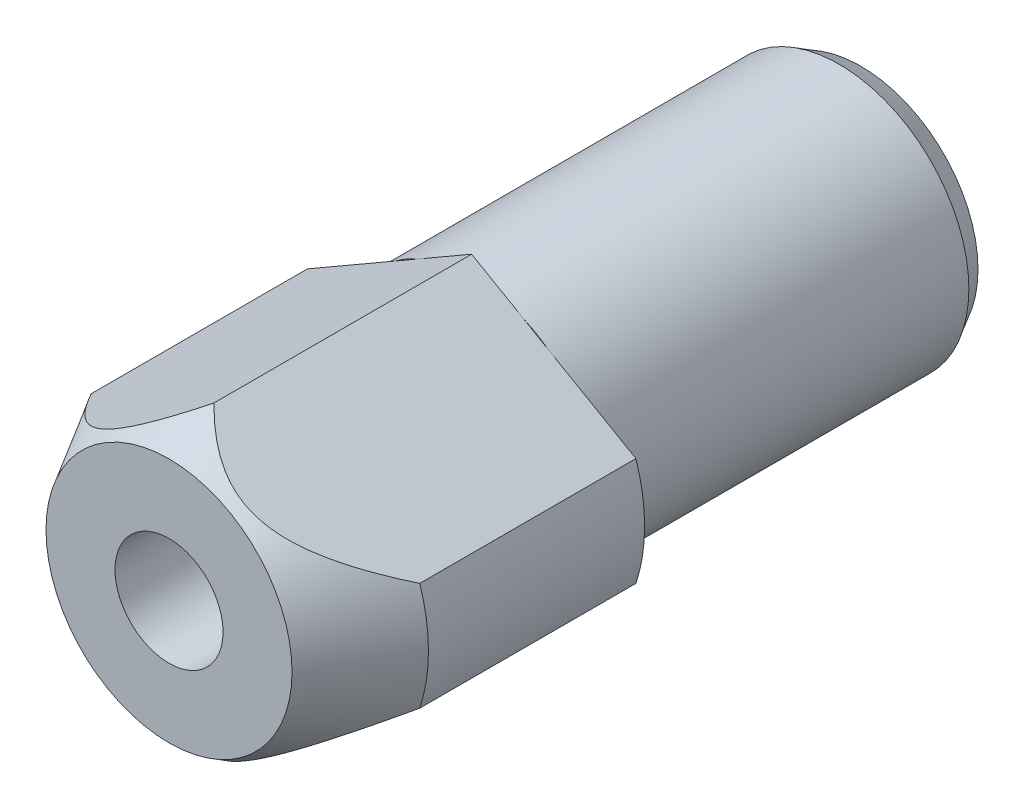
ISO-10303-21;
HEADER;
FILE_DESCRIPTION(('STEP AP214'),'2;1');
FILE_NAME('part.step','',(''),(''),'','','');
FILE_SCHEMA(('AUTOMOTIVE_DESIGN { 1 0 10303 214 1 1 1 1 }'));
ENDSEC;
DATA;
#1=APPLICATION_CONTEXT('core data for automotive mechanical design processes');
#2=APPLICATION_PROTOCOL_DEFINITION('international standard','automotive_design',2000,#1);
#3=PRODUCT_CONTEXT('',#1,'mechanical');
#4=PRODUCT('Part','Part','',(#3));
#5=PRODUCT_RELATED_PRODUCT_CATEGORY('part','',(#4));
#6=PRODUCT_DEFINITION_FORMATION('','',#4);
#7=PRODUCT_DEFINITION_CONTEXT('part definition',#1,'design');
#8=PRODUCT_DEFINITION('design','',#6,#7);
#9=PRODUCT_DEFINITION_SHAPE('','',#8);
#10=(LENGTH_UNIT() NAMED_UNIT(*) SI_UNIT(.MILLI.,.METRE.));
#11=(NAMED_UNIT(*) PLANE_ANGLE_UNIT() SI_UNIT($,.RADIAN.));
#12=(NAMED_UNIT(*) SI_UNIT($,.STERADIAN.) SOLID_ANGLE_UNIT());
#13=UNCERTAINTY_MEASURE_WITH_UNIT(LENGTH_MEASURE(1.E-05),#10,'distance_accuracy_value','');
#14=(GEOMETRIC_REPRESENTATION_CONTEXT(3) GLOBAL_UNCERTAINTY_ASSIGNED_CONTEXT((#13)) GLOBAL_UNIT_ASSIGNED_CONTEXT((#10,
#11,#12)) REPRESENTATION_CONTEXT('',''));
#15=CARTESIAN_POINT('',(0.,0.,0.));
#16=DIRECTION('',(0.,0.,1.));
#17=DIRECTION('',(1.,0.,0.));
#18=AXIS2_PLACEMENT_3D('',#15,#16,#17);
#19=CARTESIAN_POINT('',(6.,0.,0.));
#20=DIRECTION('',(0.,0.,1.));
#21=DIRECTION('',(1.,0.,0.));
#22=AXIS2_PLACEMENT_3D('',#19,#20,#21);
#23=PLANE('',#22);
#24=DIRECTION('',(-0.866025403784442,0.5,0.));
#25=VECTOR('',#24,1.);
#26=CARTESIAN_POINT('',(7.59934207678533,2.5,0.));
#27=LINE('',#26,#25);
#28=CARTESIAN_POINT('',(7.59934207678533,2.5,0.));
#29=VERTEX_POINT('',#28);
#30=CARTESIAN_POINT('',(3.54491178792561,4.8408264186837,0.));
#31=VERTEX_POINT('',#30);
#32=EDGE_CURVE('E271',#29,#31,#27,.T.);
#33=ORIENTED_EDGE('',*,*,#32,.F.);
#34=CARTESIAN_POINT('',(0.,0.,0.));
#35=DIRECTION('',(0.,0.,1.));
#36=DIRECTION('',(1.,0.,0.));
#37=AXIS2_PLACEMENT_3D('',#34,#35,#36);
#38=CIRCLE('',#37,8.);
#39=CARTESIAN_POINT('',(7.59934207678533,-2.5,0.));
#40=VERTEX_POINT('',#39);
#41=EDGE_CURVE('E119',#40,#29,#38,.T.);
#42=ORIENTED_EDGE('',*,*,#41,.F.);
#43=DIRECTION('',(-0.866025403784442,-0.5,0.));
#44=VECTOR('',#43,1.);
#45=CARTESIAN_POINT('',(7.59934207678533,-2.5,0.));
#46=LINE('',#45,#44);
#47=CARTESIAN_POINT('',(3.54491178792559,-4.84082641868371,0.));
#48=VERTEX_POINT('',#47);
#49=EDGE_CURVE('E235',#40,#48,#46,.T.);
#50=ORIENTED_EDGE('',*,*,#49,.T.);
#51=CARTESIAN_POINT('',(0.,0.,0.));
#52=DIRECTION('',(0.,0.,1.));
#53=DIRECTION('',(1.,0.,0.));
#54=AXIS2_PLACEMENT_3D('',#51,#52,#53);
#55=CIRCLE('',#54,6.);
#56=EDGE_CURVE('E277',#48,#31,#55,.T.);
#57=ORIENTED_EDGE('',*,*,#56,.T.);
#58=EDGE_LOOP('',(#33,#42,#50,#57));
#59=FACE_BOUND('',#58,.T.);
#60=ADVANCED_FACE('F14',(#59),#23,.F.);
#61=CARTESIAN_POINT('',(2.41982275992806,5.49039687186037,0.));
#62=VERTEX_POINT('',#61);
#63=CARTESIAN_POINT('',(0.,6.887482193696,0.));
#64=VERTEX_POINT('',#63);
#65=EDGE_CURVE('E270',#62,#64,#27,.T.);
#66=ORIENTED_EDGE('',*,*,#65,.F.);
#67=CARTESIAN_POINT('',(-2.41982275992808,5.49039687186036,0.));
#68=VERTEX_POINT('',#67);
#69=EDGE_CURVE('E275',#62,#68,#55,.T.);
#70=ORIENTED_EDGE('',*,*,#69,.T.);
#71=DIRECTION('',(0.866025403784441,0.5,0.));
#72=VECTOR('',#71,1.);
#73=CARTESIAN_POINT('',(-7.59934207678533,2.5,0.));
#74=LINE('',#73,#72);
#75=EDGE_CURVE('E105',#68,#64,#74,.T.);
#76=ORIENTED_EDGE('',*,*,#75,.T.);
#77=EDGE_LOOP('',(#66,#70,#76));
#78=FACE_BOUND('',#77,.T.);
#79=ADVANCED_FACE('F184',(#78),#23,.F.);
#80=CARTESIAN_POINT('',(0.,0.,30.));
#81=DIRECTION('',(0.,0.,1.));
#82=DIRECTION('',(1.,0.,0.));
#83=AXIS2_PLACEMENT_3D('',#80,#81,#82);
#84=CYLINDRICAL_SURFACE('',#83,8.);
#85=DIRECTION('',(0.,0.,1.));
#86=VECTOR('',#85,1.);
#87=CARTESIAN_POINT('',(7.59934207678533,2.5,0.));
#88=LINE('',#87,#86);
#89=CARTESIAN_POINT('',(7.59934207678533,2.5,10.));
#90=VERTEX_POINT('',#89);
#91=EDGE_CURVE('E226',#29,#90,#88,.T.);
#92=ORIENTED_EDGE('',*,*,#91,.T.);
#93=CARTESIAN_POINT('',(0.,0.,10.));
#94=DIRECTION('',(0.,0.,1.));
#95=DIRECTION('',(1.,0.,0.));
#96=AXIS2_PLACEMENT_3D('',#93,#94,#95);
#97=CIRCLE('',#96,8.);
#98=CARTESIAN_POINT('',(7.59934207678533,-2.5,10.));
#99=VERTEX_POINT('',#98);
#100=EDGE_CURVE('E120',#99,#90,#97,.T.);
#101=ORIENTED_EDGE('',*,*,#100,.F.);
#102=DIRECTION('',(0.,0.,1.));
#103=VECTOR('',#102,1.);
#104=CARTESIAN_POINT('',(7.59934207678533,-2.5,0.));
#105=LINE('',#104,#103);
#106=EDGE_CURVE('E246',#40,#99,#105,.T.);
#107=ORIENTED_EDGE('',*,*,#106,.F.);
#108=ORIENTED_EDGE('',*,*,#41,.T.);
#109=EDGE_LOOP('',(#92,#101,#107,#108));
#110=FACE_BOUND('',#109,.T.);
#111=ADVANCED_FACE('F180',(#110),#84,.T.);
#112=CARTESIAN_POINT('',(0.,0.,10.));
#113=DIRECTION('',(0.,0.,-1.));
#114=DIRECTION('',(-1.,0.,0.));
#115=AXIS2_PLACEMENT_3D('',#112,#113,#114);
#116=CONICAL_SURFACE('',#115,8.,0.523598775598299);
#117=CARTESIAN_POINT('',(0.,0.,14.));
#118=DIRECTION('',(0.,0.,1.));
#119=DIRECTION('',(1.,0.,0.));
#120=AXIS2_PLACEMENT_3D('',#117,#118,#119);
#121=CIRCLE('',#120,5.69059892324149);
#122=CARTESIAN_POINT('',(5.69059892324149,0.,14.));
#123=VERTEX_POINT('',#122);
#124=EDGE_CURVE('E217',#123,#123,#121,.T.);
#125=ORIENTED_EDGE('',*,*,#124,.F.);
#126=EDGE_LOOP('',(#125));
#127=FACE_BOUND('',#126,.T.);
#128=CARTESIAN_POINT('',(-0.000200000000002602,6.88759766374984,11.9267373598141));
#129=CARTESIAN_POINT('',(0.0621758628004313,6.8515849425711,11.989109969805));
#130=CARTESIAN_POINT('',(0.125174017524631,6.81521294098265,12.0506508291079));
#131=CARTESIAN_POINT('',(0.25255184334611,6.74167131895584,12.171837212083));
#132=CARTESIAN_POINT('',(0.316931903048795,6.70450147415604,12.2314821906));
#133=CARTESIAN_POINT('',(0.51295989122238,6.59132466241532,12.4077690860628));
#134=CARTESIAN_POINT('',(0.646862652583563,6.51401586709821,12.5211223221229));
#135=CARTESIAN_POINT('',(0.925137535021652,6.35335378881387,12.739049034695));
#136=CARTESIAN_POINT('',(1.06969195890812,6.26989525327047,12.8433150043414));
#137=CARTESIAN_POINT('',(1.36663299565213,6.09845626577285,13.0352268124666));
#138=CARTESIAN_POINT('',(1.51900131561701,6.01048637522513,13.122909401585));
#139=CARTESIAN_POINT('',(1.76048177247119,5.87106756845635,13.2413705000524));
#140=CARTESIAN_POINT('',(1.84676611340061,5.82125128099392,13.2798680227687));
#141=CARTESIAN_POINT('',(2.02159456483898,5.72031402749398,13.3494007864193));
#142=CARTESIAN_POINT('',(2.11013884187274,5.66919296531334,13.3804354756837));
#143=CARTESIAN_POINT('',(2.28843143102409,5.56625569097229,13.4338564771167));
#144=CARTESIAN_POINT('',(2.37816468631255,5.51444817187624,13.4563092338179));
#145=CARTESIAN_POINT('',(2.5589809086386,5.41005387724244,13.4921001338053));
#146=CARTESIAN_POINT('',(2.65006360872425,5.35746725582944,13.5054400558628));
#147=CARTESIAN_POINT('',(2.83378402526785,5.25139622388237,13.5225546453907));
#148=CARTESIAN_POINT('',(2.9264282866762,5.19790803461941,13.5262368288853));
#149=CARTESIAN_POINT('',(3.11160774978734,5.09099462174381,13.5236094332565));
#150=CARTESIAN_POINT('',(3.20414295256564,5.03756939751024,13.5172999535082));
#151=CARTESIAN_POINT('',(3.38848330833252,4.93114044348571,13.49494073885));
#152=CARTESIAN_POINT('',(3.48028687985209,4.87813762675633,13.4788737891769));
#153=CARTESIAN_POINT('',(3.6623393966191,4.77302955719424,13.4376314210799));
#154=CARTESIAN_POINT('',(3.75258810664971,4.72092444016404,13.4124546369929));
#155=CARTESIAN_POINT('',(3.95659491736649,4.60314105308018,13.3454884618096));
#156=CARTESIAN_POINT('',(4.06968980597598,4.53784568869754,13.3010068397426));
#157=CARTESIAN_POINT('',(4.29199124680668,4.4094998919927,13.200532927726));
#158=CARTESIAN_POINT('',(4.40119535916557,4.34645086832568,13.144533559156));
#159=CARTESIAN_POINT('',(4.61649068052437,4.22215005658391,13.0225432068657));
#160=CARTESIAN_POINT('',(4.72254600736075,4.16091898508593,12.9564685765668));
#161=CARTESIAN_POINT('',(4.93065408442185,4.04076773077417,12.8165218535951));
#162=CARTESIAN_POINT('',(5.03270776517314,3.98184701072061,12.7426515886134));
#163=CARTESIAN_POINT('',(5.25319487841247,3.85454871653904,12.5731684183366));
#164=CARTESIAN_POINT('',(5.37082122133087,3.78663711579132,12.4761620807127));
#165=CARTESIAN_POINT('',(5.6014197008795,3.65350102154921,12.2750050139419));
#166=CARTESIAN_POINT('',(5.71439022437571,3.58827745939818,12.1708518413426));
#167=CARTESIAN_POINT('',(5.93650770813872,3.46003787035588,11.9566581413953));
#168=CARTESIAN_POINT('',(6.0456447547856,3.39702756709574,11.8466039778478));
#169=CARTESIAN_POINT('',(6.26036261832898,3.27306015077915,11.6219588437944));
#170=CARTESIAN_POINT('',(6.36594307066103,3.21210324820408,11.5073674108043));
#171=CARTESIAN_POINT('',(6.56914732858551,3.0947832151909,11.2799550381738));
#172=CARTESIAN_POINT('',(6.66691236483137,3.03833854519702,11.1673017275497));
#173=CARTESIAN_POINT('',(6.85998967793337,2.92686530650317,10.9392188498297));
#174=CARTESIAN_POINT('',(6.95530179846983,2.87183682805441,10.8237891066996));
#175=CARTESIAN_POINT('',(7.1431798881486,2.76336536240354,10.591342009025));
#176=CARTESIAN_POINT('',(7.23575931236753,2.70991460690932,10.4743391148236));
#177=CARTESIAN_POINT('',(7.41901297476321,2.6041130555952,10.2384048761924));
#178=CARTESIAN_POINT('',(7.50968762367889,2.55176202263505,10.1194739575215));
#179=CARTESIAN_POINT('',(7.59954207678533,2.49988452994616,9.999733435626));
#180=B_SPLINE_CURVE_WITH_KNOTS('',3,(#128,#129,#130,#131,#132,#133,#134,#135,#136,#137,#138,
#139,#140,#141,#142,#143,#144,#145,#146,#147,#148,#149,#150,#151,#152,#153,#154,#155,#156,#157,
#158,#159,#160,#161,#162,#163,#164,#165,#166,#167,#168,#169,#170,#171,#172,#173,#174,#175,#176,
#177,#178,#179),.UNSPECIFIED.,.F.,.F.,(4,2,2,2,2,2,2,2,2,2,2,2,2,2,2,2,2,2,2,2,2,2,2,2,2,4),(0.,
0.285822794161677,0.571727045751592,1.14644748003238,1.73621258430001,2.32465498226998,
2.64484729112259,2.96506326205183,3.28274720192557,3.60036911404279,3.92102170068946,
4.24167109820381,4.56288785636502,4.88415278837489,5.29735561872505,5.71081315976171,
6.12791174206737,6.54491275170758,7.04532919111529,7.54591758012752,8.04771727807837,
8.54956825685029,9.02796034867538,9.50638285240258,9.98181067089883,10.4571348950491),.UNSPECIFIED.);
#181=CARTESIAN_POINT('',(0.,6.887482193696,11.9269373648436));
#182=VERTEX_POINT('',#181);
#183=EDGE_CURVE('E9',#182,#90,#180,.T.);
#184=ORIENTED_EDGE('',*,*,#183,.F.);
#185=CARTESIAN_POINT('',(0.000199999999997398,6.88759766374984,11.9267373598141));
#186=CARTESIAN_POINT('',(-0.0621758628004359,6.8515849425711,11.989109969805));
#187=CARTESIAN_POINT('',(-0.125174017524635,6.81521294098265,12.0506508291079));
#188=CARTESIAN_POINT('',(-0.252551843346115,6.74167131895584,12.171837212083));
#189=CARTESIAN_POINT('',(-0.3169319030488,6.70450147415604,12.2314821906));
#190=CARTESIAN_POINT('',(-0.512959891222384,6.59132466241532,12.4077690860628));
#191=CARTESIAN_POINT('',(-0.646862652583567,6.51401586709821,12.5211223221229));
#192=CARTESIAN_POINT('',(-0.925137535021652,6.35335378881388,12.739049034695));
#193=CARTESIAN_POINT('',(-1.06969195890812,6.26989525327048,12.8433150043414));
#194=CARTESIAN_POINT('',(-1.36663299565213,6.09845626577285,13.0352268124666));
#195=CARTESIAN_POINT('',(-1.51900131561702,6.01048637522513,13.1229094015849));
#196=CARTESIAN_POINT('',(-1.7604817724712,5.87106756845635,13.2413705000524));
#197=CARTESIAN_POINT('',(-1.84676611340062,5.82125128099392,13.2798680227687));
#198=CARTESIAN_POINT('',(-2.02159456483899,5.72031402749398,13.3494007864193));
#199=CARTESIAN_POINT('',(-2.11013884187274,5.66919296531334,13.3804354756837));
#200=CARTESIAN_POINT('',(-2.2884314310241,5.56625569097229,13.4338564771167));
#201=CARTESIAN_POINT('',(-2.37816468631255,5.51444817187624,13.4563092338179));
#202=CARTESIAN_POINT('',(-2.5589809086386,5.41005387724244,13.4921001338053));
#203=CARTESIAN_POINT('',(-2.65006360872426,5.35746725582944,13.5054400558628));
#204=CARTESIAN_POINT('',(-2.83378402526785,5.25139622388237,13.5225546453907));
#205=CARTESIAN_POINT('',(-2.9264282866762,5.19790803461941,13.5262368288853));
#206=CARTESIAN_POINT('',(-3.11160774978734,5.09099462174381,13.5236094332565));
#207=CARTESIAN_POINT('',(-3.20414295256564,5.03756939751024,13.5172999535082));
#208=CARTESIAN_POINT('',(-3.38848330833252,4.93114044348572,13.49494073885));
#209=CARTESIAN_POINT('',(-3.48028687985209,4.87813762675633,13.4788737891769));
#210=CARTESIAN_POINT('',(-3.66233939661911,4.77302955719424,13.4376314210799));
#211=CARTESIAN_POINT('',(-3.75258810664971,4.72092444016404,13.4124546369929));
#212=CARTESIAN_POINT('',(-3.95659491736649,4.60314105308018,13.3454884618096));
#213=CARTESIAN_POINT('',(-4.06968980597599,4.53784568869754,13.3010068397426));
#214=CARTESIAN_POINT('',(-4.29199124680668,4.4094998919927,13.2005329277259));
#215=CARTESIAN_POINT('',(-4.40119535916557,4.34645086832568,13.144533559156));
#216=CARTESIAN_POINT('',(-4.61649068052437,4.22215005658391,13.0225432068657));
#217=CARTESIAN_POINT('',(-4.72254600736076,4.16091898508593,12.9564685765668));
#218=CARTESIAN_POINT('',(-4.93065408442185,4.04076773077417,12.8165218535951));
#219=CARTESIAN_POINT('',(-5.03270776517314,3.98184701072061,12.7426515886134));
#220=CARTESIAN_POINT('',(-5.25319487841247,3.85454871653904,12.5731684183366));
#221=CARTESIAN_POINT('',(-5.37082122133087,3.78663711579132,12.4761620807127));
#222=CARTESIAN_POINT('',(-5.6014197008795,3.65350102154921,12.2750050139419));
#223=CARTESIAN_POINT('',(-5.7143902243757,3.58827745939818,12.1708518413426));
#224=CARTESIAN_POINT('',(-5.93650770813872,3.46003787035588,11.9566581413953));
#225=CARTESIAN_POINT('',(-6.0456447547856,3.39702756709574,11.8466039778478));
#226=CARTESIAN_POINT('',(-6.26036261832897,3.27306015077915,11.6219588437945));
#227=CARTESIAN_POINT('',(-6.36594307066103,3.21210324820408,11.5073674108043));
#228=CARTESIAN_POINT('',(-6.56914732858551,3.09478321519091,11.2799550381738));
#229=CARTESIAN_POINT('',(-6.66691236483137,3.03833854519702,11.1673017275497));
#230=CARTESIAN_POINT('',(-6.85998967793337,2.92686530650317,10.9392188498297));
#231=CARTESIAN_POINT('',(-6.95530179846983,2.87183682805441,10.8237891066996));
#232=CARTESIAN_POINT('',(-7.1431798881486,2.76336536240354,10.591342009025));
#233=CARTESIAN_POINT('',(-7.23575931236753,2.70991460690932,10.4743391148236));
#234=CARTESIAN_POINT('',(-7.41901297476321,2.6041130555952,10.2384048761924));
#235=CARTESIAN_POINT('',(-7.50968762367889,2.55176202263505,10.1194739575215));
#236=CARTESIAN_POINT('',(-7.59954207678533,2.49988452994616,9.999733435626));
#237=B_SPLINE_CURVE_WITH_KNOTS('',3,(#185,#186,#187,#188,#189,#190,#191,#192,#193,#194,#195,
#196,#197,#198,#199,#200,#201,#202,#203,#204,#205,#206,#207,#208,#209,#210,#211,#212,#213,#214,
#215,#216,#217,#218,#219,#220,#221,#222,#223,#224,#225,#226,#227,#228,#229,#230,#231,#232,#233,
#234,#235,#236),.UNSPECIFIED.,.F.,.F.,(4,2,2,2,2,2,2,2,2,2,2,2,2,2,2,2,2,2,2,2,2,2,2,2,2,4),(0.,
0.285822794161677,0.571727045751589,1.14644748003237,1.7362125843,2.32465498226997,
2.64484729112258,2.96506326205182,3.28274720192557,3.60036911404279,3.92102170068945,
4.2416710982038,4.56288785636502,4.88415278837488,5.29735561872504,5.71081315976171,
6.12791174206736,6.54491275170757,7.04532919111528,7.5459175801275,8.04771727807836,
8.54956825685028,9.02796034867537,9.50638285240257,9.98181067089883,10.4571348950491),.UNSPECIFIED.);
#238=CARTESIAN_POINT('',(-7.59934207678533,2.5,10.));
#239=VERTEX_POINT('',#238);
#240=EDGE_CURVE('E28',#182,#239,#237,.T.);
#241=ORIENTED_EDGE('',*,*,#240,.T.);
#242=CARTESIAN_POINT('',(-7.59934207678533,-2.5,10.));
#243=VERTEX_POINT('',#242);
#244=EDGE_CURVE('E112',#239,#243,#97,.T.);
#245=ORIENTED_EDGE('',*,*,#244,.T.);
#246=CARTESIAN_POINT('',(0.00019999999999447,-6.88759766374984,11.9267373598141));
#247=CARTESIAN_POINT('',(-0.0621758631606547,-6.85158494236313,11.9891099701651));
#248=CARTESIAN_POINT('',(-0.125174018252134,-6.81521294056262,12.0506508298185));
#249=CARTESIAN_POINT('',(-0.252551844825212,-6.74167131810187,12.1718372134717));
#250=CARTESIAN_POINT('',(-0.316931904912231,-6.70450147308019,12.2314821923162));
#251=CARTESIAN_POINT('',(-0.512959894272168,-6.59132466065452,12.407769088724));
#252=CARTESIAN_POINT('',(-0.646862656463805,-6.51401586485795,12.5211223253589));
#253=CARTESIAN_POINT('',(-0.925137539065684,-6.35335378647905,12.7390490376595));
#254=CARTESIAN_POINT('',(-1.06969196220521,-6.2698952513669,12.8433150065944));
#255=CARTESIAN_POINT('',(-1.36663299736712,-6.0984562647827,13.0352268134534));
#256=CARTESIAN_POINT('',(-1.51900131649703,-6.01048637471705,13.1229094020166));
#257=CARTESIAN_POINT('',(-1.76048177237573,-5.87106756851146,13.2413705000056));
#258=CARTESIAN_POINT('',(-1.84676611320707,-5.82125128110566,13.2798680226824));
#259=CARTESIAN_POINT('',(-2.02159456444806,-5.72031402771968,13.3494007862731));
#260=CARTESIAN_POINT('',(-2.11013884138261,-5.66919296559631,13.3804354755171));
#261=CARTESIAN_POINT('',(-2.28843143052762,-5.56625569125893,13.4338564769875));
#262=CARTESIAN_POINT('',(-2.37816468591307,-5.51444817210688,13.4563092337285));
#263=CARTESIAN_POINT('',(-2.5589809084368,-5.41005387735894,13.4921001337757));
#264=CARTESIAN_POINT('',(-2.65006360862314,-5.35746725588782,13.5054400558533));
#265=CARTESIAN_POINT('',(-2.8337840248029,-5.2513962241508,13.5225546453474));
#266=CARTESIAN_POINT('',(-2.92642828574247,-5.19790803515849,13.5262368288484));
#267=CARTESIAN_POINT('',(-3.11160774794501,-5.09099462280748,13.5236094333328));
#268=CARTESIAN_POINT('',(-3.20414295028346,-5.03756939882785,13.517299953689));
#269=CARTESIAN_POINT('',(-3.38848330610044,-4.93114044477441,13.494940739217));
#270=CARTESIAN_POINT('',(-3.4802868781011,-4.87813762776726,13.4788737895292));
#271=CARTESIAN_POINT('',(-3.66233939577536,-4.77302955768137,13.4376314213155));
#272=CARTESIAN_POINT('',(-3.75258810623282,-4.72092444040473,13.4124546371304));
#273=CARTESIAN_POINT('',(-3.95659492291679,-4.60314104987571,13.3454884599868));
#274=CARTESIAN_POINT('',(-4.06968981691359,-4.5378456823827,13.3010068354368));
#275=CARTESIAN_POINT('',(-4.29199126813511,-4.40949987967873,13.200532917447));
#276=CARTESIAN_POINT('',(-4.40119538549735,-4.34645085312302,13.1445335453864));
#277=CARTESIAN_POINT('',(-4.61649070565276,-4.22215004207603,13.0225431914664));
#278=CARTESIAN_POINT('',(-4.72254602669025,-4.16091897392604,12.9564685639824));
#279=CARTESIAN_POINT('',(-4.93065409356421,-4.04076772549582,12.8165218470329));
#280=CARTESIAN_POINT('',(-5.03270776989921,-3.98184700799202,12.7426515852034));
#281=CARTESIAN_POINT('',(-5.25319208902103,-3.85455032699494,12.5731705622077));
#282=CARTESIAN_POINT('',(-5.37081576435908,-3.78664026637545,12.4761665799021));
#283=CARTESIAN_POINT('',(-5.60140910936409,-3.65350713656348,12.2750145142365));
#284=CARTESIAN_POINT('',(-5.71437716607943,-3.58828499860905,12.1708639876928));
#285=CARTESIAN_POINT('',(-5.93648986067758,-3.46004817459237,11.956675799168));
#286=CARTESIAN_POINT('',(-6.04562458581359,-3.39703921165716,11.8466245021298));
#287=CARTESIAN_POINT('',(-6.26033793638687,-3.27307440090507,11.6219852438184));
#288=CARTESIAN_POINT('',(-6.36591619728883,-3.21211876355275,11.5073968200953));
#289=CARTESIAN_POINT('',(-6.56911642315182,-3.09480105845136,11.279990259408));
#290=CARTESIAN_POINT('',(-6.66687960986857,-3.03835745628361,11.1673397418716));
#291=CARTESIAN_POINT('',(-6.85995329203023,-2.92688631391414,10.939262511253));
#292=CARTESIAN_POINT('',(-6.95526363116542,-2.87185886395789,10.8238356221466));
#293=CARTESIAN_POINT('',(-7.14313824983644,-2.76338940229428,10.591394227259));
#294=CARTESIAN_POINT('',(-7.23571598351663,-2.70993962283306,10.4743941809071));
#295=CARTESIAN_POINT('',(-7.41896630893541,-2.60413999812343,10.2384656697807));
#296=CARTESIAN_POINT('',(-7.509639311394,-2.55178991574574,10.1195376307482));
#297=CARTESIAN_POINT('',(-7.59949213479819,-2.49991336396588,9.9998));
#298=B_SPLINE_CURVE_WITH_KNOTS('',3,(#246,#247,#248,#249,#250,#251,#252,#253,#254,#255,#256,
#257,#258,#259,#260,#261,#262,#263,#264,#265,#266,#267,#268,#269,#270,#271,#272,#273,#274,#275,
#276,#277,#278,#279,#280,#281,#282,#283,#284,#285,#286,#287,#288,#289,#290,#291,#292,#293,#294,
#295,#296,#297),.UNSPECIFIED.,.F.,.F.,(4,2,2,2,2,2,2,2,2,2,2,2,2,2,2,2,2,2,2,2,2,2,2,2,2,4),(0.,
0.285822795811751,0.571727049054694,1.14644748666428,1.73621258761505,2.32465498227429,
2.64484729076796,2.96506326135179,3.282747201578,3.60036911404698,3.92102169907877,
4.24167109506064,4.56288785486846,4.88415278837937,5.29735563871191,5.71081319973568,
6.12791176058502,6.54491275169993,7.04531758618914,7.5458943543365,8.04768234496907,
8.54952161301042,9.0279032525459,9.50631530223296,9.98173286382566,10.4570468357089),.UNSPECIFIED.);
#299=CARTESIAN_POINT('',(0.,-6.887482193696,11.9269373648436));
#300=VERTEX_POINT('',#299);
#301=EDGE_CURVE('E143',#300,#243,#298,.T.);
#302=ORIENTED_EDGE('',*,*,#301,.F.);
#303=CARTESIAN_POINT('',(-0.000200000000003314,-6.88759766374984,11.9267373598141));
#304=CARTESIAN_POINT('',(0.0621758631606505,-6.85158494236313,11.9891099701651));
#305=CARTESIAN_POINT('',(0.125174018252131,-6.81521294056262,12.0506508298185));
#306=CARTESIAN_POINT('',(0.252551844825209,-6.74167131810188,12.1718372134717));
#307=CARTESIAN_POINT('',(0.316931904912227,-6.70450147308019,12.2314821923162));
#308=CARTESIAN_POINT('',(0.512959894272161,-6.59132466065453,12.407769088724));
#309=CARTESIAN_POINT('',(0.6468626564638,-6.51401586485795,12.5211223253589));
#310=CARTESIAN_POINT('',(0.925137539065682,-6.35335378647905,12.7390490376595));
#311=CARTESIAN_POINT('',(1.06969196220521,-6.26989525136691,12.8433150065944));
#312=CARTESIAN_POINT('',(1.36663299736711,-6.0984562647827,13.0352268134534));
#313=CARTESIAN_POINT('',(1.51900131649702,-6.01048637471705,13.1229094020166));
#314=CARTESIAN_POINT('',(1.76048177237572,-5.87106756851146,13.2413705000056));
#315=CARTESIAN_POINT('',(1.84676611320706,-5.82125128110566,13.2798680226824));
#316=CARTESIAN_POINT('',(2.02159456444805,-5.72031402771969,13.3494007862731));
#317=CARTESIAN_POINT('',(2.11013884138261,-5.66919296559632,13.3804354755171));
#318=CARTESIAN_POINT('',(2.28843143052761,-5.56625569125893,13.4338564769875));
#319=CARTESIAN_POINT('',(2.37816468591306,-5.51444817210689,13.4563092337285));
#320=CARTESIAN_POINT('',(2.55898090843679,-5.41005387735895,13.4921001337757));
#321=CARTESIAN_POINT('',(2.65006360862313,-5.35746725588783,13.5054400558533));
#322=CARTESIAN_POINT('',(2.83378402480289,-5.25139622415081,13.5225546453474));
#323=CARTESIAN_POINT('',(2.92642828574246,-5.1979080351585,13.5262368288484));
#324=CARTESIAN_POINT('',(3.111607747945,-5.09099462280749,13.5236094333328));
#325=CARTESIAN_POINT('',(3.20414295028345,-5.03756939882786,13.517299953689));
#326=CARTESIAN_POINT('',(3.38848330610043,-4.93114044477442,13.494940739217));
#327=CARTESIAN_POINT('',(3.48028687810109,-4.87813762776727,13.4788737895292));
#328=CARTESIAN_POINT('',(3.66233939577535,-4.77302955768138,13.4376314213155));
#329=CARTESIAN_POINT('',(3.75258810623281,-4.72092444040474,13.4124546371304));
#330=CARTESIAN_POINT('',(3.95659492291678,-4.60314104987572,13.3454884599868));
#331=CARTESIAN_POINT('',(4.06968981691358,-4.53784568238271,13.3010068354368));
#332=CARTESIAN_POINT('',(4.2919912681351,-4.40949987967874,13.200532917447));
#333=CARTESIAN_POINT('',(4.40119538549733,-4.34645085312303,13.1445335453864));
#334=CARTESIAN_POINT('',(4.61649070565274,-4.22215004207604,13.0225431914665));
#335=CARTESIAN_POINT('',(4.72254602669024,-4.16091897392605,12.9564685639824));
#336=CARTESIAN_POINT('',(4.9306540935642,-4.04076772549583,12.8165218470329));
#337=CARTESIAN_POINT('',(5.0327077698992,-3.98184700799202,12.7426515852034));
#338=CARTESIAN_POINT('',(5.25319208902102,-3.85455032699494,12.5731705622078));
#339=CARTESIAN_POINT('',(5.37081576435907,-3.78664026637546,12.4761665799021));
#340=CARTESIAN_POINT('',(5.60140910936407,-3.65350713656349,12.2750145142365));
#341=CARTESIAN_POINT('',(5.71437716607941,-3.58828499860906,12.1708639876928));
#342=CARTESIAN_POINT('',(5.93648986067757,-3.46004817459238,11.956675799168));
#343=CARTESIAN_POINT('',(6.04562458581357,-3.39703921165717,11.8466245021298));
#344=CARTESIAN_POINT('',(6.26033793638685,-3.27307440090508,11.6219852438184));
#345=CARTESIAN_POINT('',(6.36591619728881,-3.21211876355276,11.5073968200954));
#346=CARTESIAN_POINT('',(6.56911642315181,-3.09480105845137,11.279990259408));
#347=CARTESIAN_POINT('',(6.66687960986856,-3.03835745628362,11.1673397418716));
#348=CARTESIAN_POINT('',(6.85995329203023,-2.92688631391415,10.939262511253));
#349=CARTESIAN_POINT('',(6.95526363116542,-2.87185886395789,10.8238356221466));
#350=CARTESIAN_POINT('',(7.14313824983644,-2.76338940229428,10.591394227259));
#351=CARTESIAN_POINT('',(7.23571598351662,-2.70993962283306,10.4743941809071));
#352=CARTESIAN_POINT('',(7.41896630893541,-2.60413999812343,10.2384656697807));
#353=CARTESIAN_POINT('',(7.509639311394,-2.55178991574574,10.1195376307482));
#354=CARTESIAN_POINT('',(7.59949213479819,-2.49991336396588,9.9998));
#355=B_SPLINE_CURVE_WITH_KNOTS('',3,(#303,#304,#305,#306,#307,#308,#309,#310,#311,#312,#313,
#314,#315,#316,#317,#318,#319,#320,#321,#322,#323,#324,#325,#326,#327,#328,#329,#330,#331,#332,
#333,#334,#335,#336,#337,#338,#339,#340,#341,#342,#343,#344,#345,#346,#347,#348,#349,#350,#351,
#352,#353,#354),.UNSPECIFIED.,.F.,.F.,(4,2,2,2,2,2,2,2,2,2,2,2,2,2,2,2,2,2,2,2,2,2,2,2,2,4),(0.,
0.28582279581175,0.571727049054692,1.14644748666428,1.73621258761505,2.32465498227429,
2.64484729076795,2.96506326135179,3.28274720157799,3.60036911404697,3.92102169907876,
4.24167109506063,4.56288785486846,4.88415278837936,5.2973556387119,5.71081319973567,
6.12791176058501,6.54491275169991,7.04531758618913,7.54589435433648,8.04768234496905,
8.54952161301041,9.02790325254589,9.50631530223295,9.98173286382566,10.4570468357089),.UNSPECIFIED.);
#356=EDGE_CURVE('E150',#300,#99,#355,.T.);
#357=ORIENTED_EDGE('',*,*,#356,.T.);
#358=ORIENTED_EDGE('',*,*,#100,.T.);
#359=EDGE_LOOP('',(#184,#241,#245,#302,#357,#358));
#360=FACE_BOUND('',#359,.T.);
#361=ADVANCED_FACE('F156',(#127,#360),#116,.T.);
#362=CARTESIAN_POINT('',(-7.59934207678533,2.5,0.));
#363=VERTEX_POINT('',#362);
#364=CARTESIAN_POINT('',(-7.59934207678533,-2.5,0.));
#365=VERTEX_POINT('',#364);
#366=EDGE_CURVE('E110',#363,#365,#38,.T.);
#367=ORIENTED_EDGE('',*,*,#366,.F.);
#368=CARTESIAN_POINT('',(-3.54491178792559,4.84082641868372,0.));
#369=VERTEX_POINT('',#368);
#370=EDGE_CURVE('E96',#363,#369,#74,.T.);
#371=ORIENTED_EDGE('',*,*,#370,.T.);
#372=CARTESIAN_POINT('',(-3.54491178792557,-4.84082641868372,0.));
#373=VERTEX_POINT('',#372);
#374=EDGE_CURVE('E123',#369,#373,#55,.T.);
#375=ORIENTED_EDGE('',*,*,#374,.T.);
#376=DIRECTION('',(0.866025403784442,-0.5,0.));
#377=VECTOR('',#376,1.);
#378=CARTESIAN_POINT('',(-7.59934207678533,-2.5,0.));
#379=LINE('',#378,#377);
#380=EDGE_CURVE('E118',#365,#373,#379,.T.);
#381=ORIENTED_EDGE('',*,*,#380,.F.);
#382=EDGE_LOOP('',(#367,#371,#375,#381));
#383=FACE_BOUND('',#382,.T.);
#384=ADVANCED_FACE('F116',(#383),#23,.F.);
#385=CARTESIAN_POINT('',(0.,0.,-14.));
#386=DIRECTION('',(0.,0.,1.));
#387=DIRECTION('',(1.,0.,0.));
#388=AXIS2_PLACEMENT_3D('',#385,#386,#387);
#389=PLANE('',#388);
#390=CARTESIAN_POINT('',(0.,0.,-14.));
#391=DIRECTION('',(0.,0.,1.));
#392=DIRECTION('',(1.,0.,0.));
#393=AXIS2_PLACEMENT_3D('',#390,#391,#392);
#394=CIRCLE('',#393,1.);
#395=CARTESIAN_POINT('',(1.,0.,-14.));
#396=VERTEX_POINT('',#395);
#397=EDGE_CURVE('E140',#396,#396,#394,.T.);
#398=ORIENTED_EDGE('',*,*,#397,.F.);
#399=EDGE_LOOP('',(#398));
#400=FACE_BOUND('',#399,.T.);
#401=ADVANCED_FACE('F16',(#400),#389,.F.);
#402=CARTESIAN_POINT('',(0.,0.,30.));
#403=DIRECTION('',(0.,0.,1.));
#404=DIRECTION('',(1.,0.,0.));
#405=AXIS2_PLACEMENT_3D('',#402,#403,#404);
#406=CYLINDRICAL_SURFACE('',#405,1.);
#407=CARTESIAN_POINT('',(0.,0.,-18.));
#408=DIRECTION('',(0.,0.,1.));
#409=DIRECTION('',(1.,0.,0.));
#410=AXIS2_PLACEMENT_3D('',#407,#408,#409);
#411=CIRCLE('',#410,1.);
#412=CARTESIAN_POINT('',(1.,0.,-18.));
#413=VERTEX_POINT('',#412);
#414=EDGE_CURVE('E137',#413,#413,#411,.T.);
#415=ORIENTED_EDGE('',*,*,#414,.F.);
#416=EDGE_LOOP('',(#415));
#417=FACE_BOUND('',#416,.T.);
#418=ORIENTED_EDGE('',*,*,#397,.T.);
#419=EDGE_LOOP('',(#418));
#420=FACE_BOUND('',#419,.T.);
#421=ADVANCED_FACE('F207',(#417,#420),#406,.F.);
#422=CARTESIAN_POINT('',(1.,0.,-18.));
#423=DIRECTION('',(0.,0.,1.));
#424=DIRECTION('',(1.,0.,0.));
#425=AXIS2_PLACEMENT_3D('',#422,#423,#424);
#426=PLANE('',#425);
#427=CARTESIAN_POINT('',(0.,0.,-18.));
#428=DIRECTION('',(0.,0.,1.));
#429=DIRECTION('',(1.,0.,0.));
#430=AXIS2_PLACEMENT_3D('',#427,#428,#429);
#431=CIRCLE('',#430,5.42264973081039);
#432=CARTESIAN_POINT('',(5.42264973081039,0.,-18.));
#433=VERTEX_POINT('',#432);
#434=EDGE_CURVE('E134',#433,#433,#431,.T.);
#435=ORIENTED_EDGE('',*,*,#434,.F.);
#436=EDGE_LOOP('',(#435));
#437=FACE_BOUND('',#436,.T.);
#438=ORIENTED_EDGE('',*,*,#414,.T.);
#439=EDGE_LOOP('',(#438));
#440=FACE_BOUND('',#439,.T.);
#441=ADVANCED_FACE('F425',(#437,#440),#426,.F.);
#442=CARTESIAN_POINT('',(0.,0.,-17.));
#443=DIRECTION('',(0.,0.,1.));
#444=DIRECTION('',(1.,0.,0.));
#445=AXIS2_PLACEMENT_3D('',#442,#443,#444);
#446=CONICAL_SURFACE('',#445,6.,0.523598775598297);
#447=ORIENTED_EDGE('',*,*,#434,.T.);
#448=EDGE_LOOP('',(#447));
#449=FACE_BOUND('',#448,.T.);
#450=CARTESIAN_POINT('',(0.,0.,-17.));
#451=DIRECTION('',(0.,0.,1.));
#452=DIRECTION('',(1.,0.,0.));
#453=AXIS2_PLACEMENT_3D('',#450,#451,#452);
#454=CIRCLE('',#453,6.);
#455=CARTESIAN_POINT('',(6.,0.,-17.));
#456=VERTEX_POINT('',#455);
#457=EDGE_CURVE('E130',#456,#456,#454,.T.);
#458=ORIENTED_EDGE('',*,*,#457,.F.);
#459=EDGE_LOOP('',(#458));
#460=FACE_BOUND('',#459,.T.);
#461=ADVANCED_FACE('F199',(#449,#460),#446,.T.);
#462=CARTESIAN_POINT('',(0.,0.,30.));
#463=DIRECTION('',(0.,0.,1.));
#464=DIRECTION('',(1.,0.,0.));
#465=AXIS2_PLACEMENT_3D('',#462,#463,#464);
#466=CYLINDRICAL_SURFACE('',#465,6.);
#467=CARTESIAN_POINT('',(-2.4198227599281,-5.49039687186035,0.));
#468=VERTEX_POINT('',#467);
#469=EDGE_CURVE('E128',#373,#468,#55,.T.);
#470=ORIENTED_EDGE('',*,*,#469,.F.);
#471=ORIENTED_EDGE('',*,*,#374,.F.);
#472=CARTESIAN_POINT('',(0.,0.,0.));
#473=DIRECTION('',(0.,0.,1.));
#474=DIRECTION('',(1.,0.,0.));
#475=AXIS2_PLACEMENT_3D('',#472,#473,#474);
#476=CIRCLE('',#475,6.);
#477=EDGE_CURVE('E229',#68,#369,#476,.T.);
#478=ORIENTED_EDGE('',*,*,#477,.F.);
#479=ORIENTED_EDGE('',*,*,#69,.F.);
#480=EDGE_CURVE('E231',#31,#62,#476,.T.);
#481=ORIENTED_EDGE('',*,*,#480,.F.);
#482=ORIENTED_EDGE('',*,*,#56,.F.);
#483=CARTESIAN_POINT('',(0.,0.,0.));
#484=DIRECTION('',(0.,0.,1.));
#485=DIRECTION('',(1.,0.,0.));
#486=AXIS2_PLACEMENT_3D('',#483,#484,#485);
#487=CIRCLE('',#486,6.);
#488=CARTESIAN_POINT('',(2.41982275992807,-5.49039687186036,0.));
#489=VERTEX_POINT('',#488);
#490=EDGE_CURVE('E248',#489,#48,#487,.T.);
#491=ORIENTED_EDGE('',*,*,#490,.F.);
#492=EDGE_CURVE('E131',#468,#489,#55,.T.);
#493=ORIENTED_EDGE('',*,*,#492,.F.);
#494=EDGE_LOOP('',(#470,#471,#478,#479,#481,#482,#491,#493));
#495=FACE_BOUND('',#494,.T.);
#496=ORIENTED_EDGE('',*,*,#457,.T.);
#497=EDGE_LOOP('',(#496));
#498=FACE_BOUND('',#497,.T.);
#499=ADVANCED_FACE('F194',(#495,#498),#466,.T.);
#500=ORIENTED_EDGE('',*,*,#492,.T.);
#501=CARTESIAN_POINT('',(0.,-6.887482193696,0.));
#502=VERTEX_POINT('',#501);
#503=EDGE_CURVE('E239',#489,#502,#46,.T.);
#504=ORIENTED_EDGE('',*,*,#503,.T.);
#505=EDGE_CURVE('E242',#468,#502,#379,.T.);
#506=ORIENTED_EDGE('',*,*,#505,.F.);
#507=EDGE_LOOP('',(#500,#504,#506));
#508=FACE_BOUND('',#507,.T.);
#509=ADVANCED_FACE('F179',(#508),#23,.F.);
#510=ORIENTED_EDGE('',*,*,#244,.F.);
#511=DIRECTION('',(0.,0.,1.));
#512=VECTOR('',#511,1.);
#513=CARTESIAN_POINT('',(-7.59934207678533,2.5,0.));
#514=LINE('',#513,#512);
#515=EDGE_CURVE('E35',#363,#239,#514,.T.);
#516=ORIENTED_EDGE('',*,*,#515,.F.);
#517=ORIENTED_EDGE('',*,*,#366,.T.);
#518=DIRECTION('',(0.,0.,1.));
#519=VECTOR('',#518,1.);
#520=CARTESIAN_POINT('',(-7.59934207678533,-2.5,0.));
#521=LINE('',#520,#519);
#522=EDGE_CURVE('E244',#365,#243,#521,.T.);
#523=ORIENTED_EDGE('',*,*,#522,.T.);
#524=EDGE_LOOP('',(#510,#516,#517,#523));
#525=FACE_BOUND('',#524,.T.);
#526=ADVANCED_FACE('F108',(#525),#84,.T.);
#527=CARTESIAN_POINT('',(5.69059892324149,0.,14.));
#528=DIRECTION('',(0.,0.,-1.));
#529=DIRECTION('',(-1.,0.,0.));
#530=AXIS2_PLACEMENT_3D('',#527,#528,#529);
#531=PLANE('',#530);
#532=CARTESIAN_POINT('',(0.,0.,14.));
#533=DIRECTION('',(0.,0.,1.));
#534=DIRECTION('',(1.,0.,0.));
#535=AXIS2_PLACEMENT_3D('',#532,#533,#534);
#536=CIRCLE('',#535,2.5);
#537=CARTESIAN_POINT('',(2.5,0.,14.));
#538=VERTEX_POINT('',#537);
#539=EDGE_CURVE('E250',#538,#538,#536,.T.);
#540=ORIENTED_EDGE('',*,*,#539,.F.);
#541=EDGE_LOOP('',(#540));
#542=FACE_BOUND('',#541,.T.);
#543=ORIENTED_EDGE('',*,*,#124,.T.);
#544=EDGE_LOOP('',(#543));
#545=FACE_BOUND('',#544,.T.);
#546=ADVANCED_FACE('F171',(#542,#545),#531,.F.);
#547=CARTESIAN_POINT('',(0.,0.,30.));
#548=DIRECTION('',(0.,0.,1.));
#549=DIRECTION('',(1.,0.,0.));
#550=AXIS2_PLACEMENT_3D('',#547,#548,#549);
#551=CYLINDRICAL_SURFACE('',#550,2.5);
#552=CARTESIAN_POINT('',(0.,0.,6.));
#553=DIRECTION('',(0.,0.,1.));
#554=DIRECTION('',(1.,0.,0.));
#555=AXIS2_PLACEMENT_3D('',#552,#553,#554);
#556=CIRCLE('',#555,2.5);
#557=CARTESIAN_POINT('',(2.5,0.,6.));
#558=VERTEX_POINT('',#557);
#559=EDGE_CURVE('E276',#558,#558,#556,.T.);
#560=ORIENTED_EDGE('',*,*,#559,.F.);
#561=EDGE_LOOP('',(#560));
#562=FACE_BOUND('',#561,.T.);
#563=ORIENTED_EDGE('',*,*,#539,.T.);
#564=EDGE_LOOP('',(#563));
#565=FACE_BOUND('',#564,.T.);
#566=ADVANCED_FACE('F168',(#562,#565),#551,.F.);
#567=CARTESIAN_POINT('',(0.,0.,0.));
#568=DIRECTION('',(0.,0.,1.));
#569=DIRECTION('',(1.,0.,0.));
#570=AXIS2_PLACEMENT_3D('',#567,#568,#569);
#571=PLANE('',#570);
#572=ORIENTED_EDGE('',*,*,#469,.T.);
#573=EDGE_CURVE('E241',#373,#468,#379,.T.);
#574=ORIENTED_EDGE('',*,*,#573,.F.);
#575=EDGE_LOOP('',(#572,#574));
#576=FACE_BOUND('',#575,.T.);
#577=ADVANCED_FACE('F170',(#576),#571,.T.);
#578=ORIENTED_EDGE('',*,*,#490,.T.);
#579=EDGE_CURVE('E238',#48,#489,#46,.T.);
#580=ORIENTED_EDGE('',*,*,#579,.T.);
#581=EDGE_LOOP('',(#578,#580));
#582=FACE_BOUND('',#581,.T.);
#583=ADVANCED_FACE('F283',(#582),#571,.T.);
#584=CARTESIAN_POINT('',(7.59934207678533,-2.5,0.));
#585=DIRECTION('',(-0.5,0.866025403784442,0.));
#586=DIRECTION('',(-0.866025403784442,-0.5,0.));
#587=AXIS2_PLACEMENT_3D('',#584,#585,#586);
#588=PLANE('',#587);
#589=DIRECTION('',(0.,0.,1.));
#590=VECTOR('',#589,1.);
#591=CARTESIAN_POINT('',(0.,-6.887482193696,0.));
#592=LINE('',#591,#590);
#593=EDGE_CURVE('E43',#502,#300,#592,.T.);
#594=ORIENTED_EDGE('',*,*,#593,.F.);
#595=ORIENTED_EDGE('',*,*,#503,.F.);
#596=ORIENTED_EDGE('',*,*,#579,.F.);
#597=ORIENTED_EDGE('',*,*,#49,.F.);
#598=ORIENTED_EDGE('',*,*,#106,.T.);
#599=ORIENTED_EDGE('',*,*,#356,.F.);
#600=EDGE_LOOP('',(#594,#595,#596,#597,#598,#599));
#601=FACE_BOUND('',#600,.T.);
#602=ADVANCED_FACE('F165',(#601),#588,.F.);
#603=CARTESIAN_POINT('',(-7.59934207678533,-2.5,0.));
#604=DIRECTION('',(-0.5,-0.866025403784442,0.));
#605=DIRECTION('',(0.866025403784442,-0.5,0.));
#606=AXIS2_PLACEMENT_3D('',#603,#604,#605);
#607=PLANE('',#606);
#608=ORIENTED_EDGE('',*,*,#301,.T.);
#609=ORIENTED_EDGE('',*,*,#522,.F.);
#610=ORIENTED_EDGE('',*,*,#380,.T.);
#611=ORIENTED_EDGE('',*,*,#573,.T.);
#612=ORIENTED_EDGE('',*,*,#505,.T.);
#613=ORIENTED_EDGE('',*,*,#593,.T.);
#614=EDGE_LOOP('',(#608,#609,#610,#611,#612,#613));
#615=FACE_BOUND('',#614,.T.);
#616=ADVANCED_FACE('F160',(#615),#607,.T.);
#617=CARTESIAN_POINT('',(0.,0.,0.));
#618=DIRECTION('',(0.,0.,1.));
#619=DIRECTION('',(1.,0.,0.));
#620=AXIS2_PLACEMENT_3D('',#617,#618,#619);
#621=PLANE('',#620);
#622=ORIENTED_EDGE('',*,*,#480,.T.);
#623=EDGE_CURVE('E265',#31,#62,#27,.T.);
#624=ORIENTED_EDGE('',*,*,#623,.F.);
#625=EDGE_LOOP('',(#622,#624));
#626=FACE_BOUND('',#625,.T.);
#627=ADVANCED_FACE('F164',(#626),#621,.T.);
#628=ORIENTED_EDGE('',*,*,#477,.T.);
#629=EDGE_CURVE('E100',#369,#68,#74,.T.);
#630=ORIENTED_EDGE('',*,*,#629,.T.);
#631=EDGE_LOOP('',(#628,#630));
#632=FACE_BOUND('',#631,.T.);
#633=ADVANCED_FACE('F298',(#632),#621,.T.);
#634=CARTESIAN_POINT('',(7.59934207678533,2.5,0.));
#635=DIRECTION('',(0.5,0.866025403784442,0.));
#636=DIRECTION('',(-0.866025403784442,0.5,0.));
#637=AXIS2_PLACEMENT_3D('',#634,#635,#636);
#638=PLANE('',#637);
#639=ORIENTED_EDGE('',*,*,#183,.T.);
#640=ORIENTED_EDGE('',*,*,#91,.F.);
#641=ORIENTED_EDGE('',*,*,#32,.T.);
#642=ORIENTED_EDGE('',*,*,#623,.T.);
#643=ORIENTED_EDGE('',*,*,#65,.T.);
#644=DIRECTION('',(0.,0.,1.));
#645=VECTOR('',#644,1.);
#646=CARTESIAN_POINT('',(0.,6.887482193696,0.));
#647=LINE('',#646,#645);
#648=EDGE_CURVE('E113',#64,#182,#647,.T.);
#649=ORIENTED_EDGE('',*,*,#648,.T.);
#650=EDGE_LOOP('',(#639,#640,#641,#642,#643,#649));
#651=FACE_BOUND('',#650,.T.);
#652=ADVANCED_FACE('F224',(#651),#638,.T.);
#653=CARTESIAN_POINT('',(-7.59934207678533,2.5,0.));
#654=DIRECTION('',(0.5,-0.866025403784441,0.));
#655=DIRECTION('',(0.866025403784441,0.5,0.));
#656=AXIS2_PLACEMENT_3D('',#653,#654,#655);
#657=PLANE('',#656);
#658=ORIENTED_EDGE('',*,*,#648,.F.);
#659=ORIENTED_EDGE('',*,*,#75,.F.);
#660=ORIENTED_EDGE('',*,*,#629,.F.);
#661=ORIENTED_EDGE('',*,*,#370,.F.);
#662=ORIENTED_EDGE('',*,*,#515,.T.);
#663=ORIENTED_EDGE('',*,*,#240,.F.);
#664=EDGE_LOOP('',(#658,#659,#660,#661,#662,#663));
#665=FACE_BOUND('',#664,.T.);
#666=ADVANCED_FACE('F98',(#665),#657,.F.);
#667=CARTESIAN_POINT('',(0.,0.,6.));
#668=DIRECTION('',(0.,0.,1.));
#669=DIRECTION('',(1.,0.,0.));
#670=AXIS2_PLACEMENT_3D('',#667,#668,#669);
#671=PLANE('',#670);
#672=ORIENTED_EDGE('',*,*,#559,.T.);
#673=EDGE_LOOP('',(#672));
#674=FACE_BOUND('',#673,.T.);
#675=ADVANCED_FACE('F288',(#674),#671,.T.);
#676=CLOSED_SHELL('',(#60,#79,#111,#361,#384,#401,#421,#441,#461,#499,#509,#526,#546,#566,#577,
#583,#602,#616,#627,#633,#652,#666,#675));
#677=MANIFOLD_SOLID_BREP('B1',#676);
#678=ADVANCED_BREP_SHAPE_REPRESENTATION('',(#18,#677),#14);
#679=SHAPE_DEFINITION_REPRESENTATION(#9,#678);
ENDSEC;
END-ISO-10303-21;
